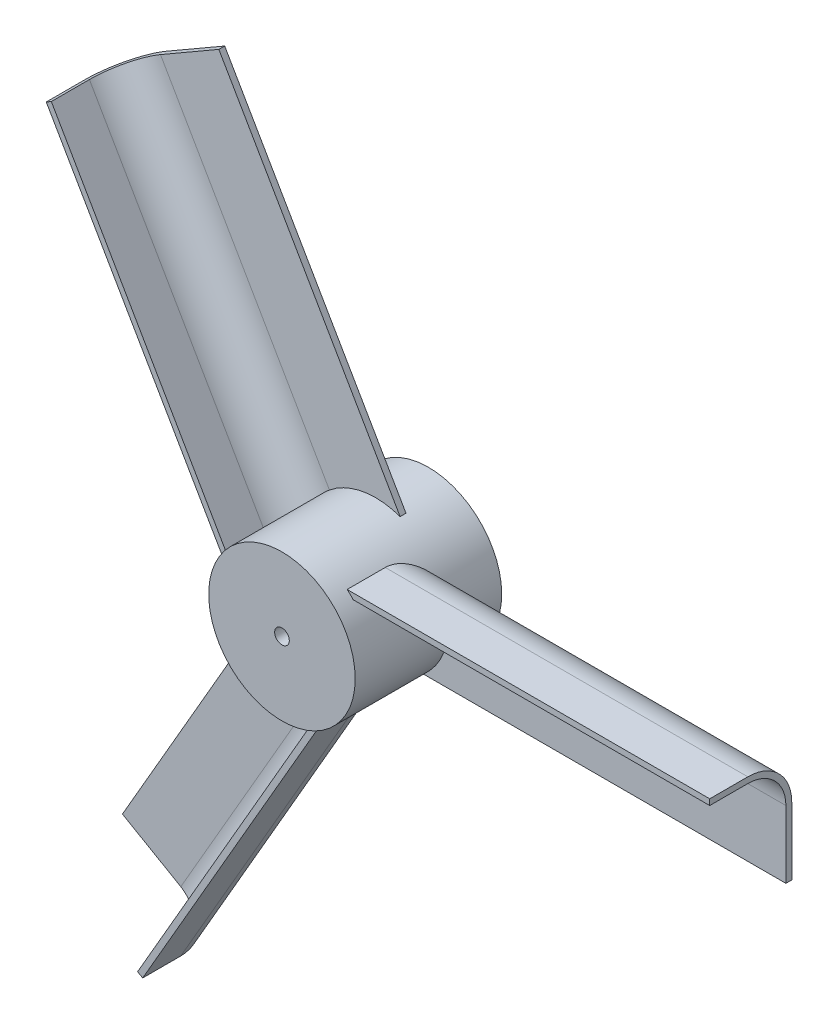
ISO-10303-21;
HEADER;
FILE_DESCRIPTION(('STEP AP214'),'2;1');
FILE_NAME('part.step','',(''),(''),'','','');
FILE_SCHEMA(('AUTOMOTIVE_DESIGN { 1 0 10303 214 1 1 1 1 }'));
ENDSEC;
DATA;
#1=APPLICATION_CONTEXT('core data for automotive mechanical design processes');
#2=APPLICATION_PROTOCOL_DEFINITION('international standard','automotive_design',2000,#1);
#3=PRODUCT_CONTEXT('',#1,'mechanical');
#4=PRODUCT('Part','Part','',(#3));
#5=PRODUCT_RELATED_PRODUCT_CATEGORY('part','',(#4));
#6=PRODUCT_DEFINITION_FORMATION('','',#4);
#7=PRODUCT_DEFINITION_CONTEXT('part definition',#1,'design');
#8=PRODUCT_DEFINITION('design','',#6,#7);
#9=PRODUCT_DEFINITION_SHAPE('','',#8);
#10=(LENGTH_UNIT() NAMED_UNIT(*) SI_UNIT(.MILLI.,.METRE.));
#11=(NAMED_UNIT(*) PLANE_ANGLE_UNIT() SI_UNIT($,.RADIAN.));
#12=(NAMED_UNIT(*) SI_UNIT($,.STERADIAN.) SOLID_ANGLE_UNIT());
#13=UNCERTAINTY_MEASURE_WITH_UNIT(LENGTH_MEASURE(1.E-05),#10,'distance_accuracy_value','');
#14=(GEOMETRIC_REPRESENTATION_CONTEXT(3) GLOBAL_UNCERTAINTY_ASSIGNED_CONTEXT((#13)) GLOBAL_UNIT_ASSIGNED_CONTEXT((#10,
#11,#12)) REPRESENTATION_CONTEXT('',''));
#15=CARTESIAN_POINT('',(0.,0.,0.));
#16=DIRECTION('',(0.,0.,1.));
#17=DIRECTION('',(1.,0.,0.));
#18=AXIS2_PLACEMENT_3D('',#15,#16,#17);
#19=CARTESIAN_POINT('',(0.,0.,25.));
#20=DIRECTION('',(0.,0.,1.));
#21=DIRECTION('',(1.,0.,0.));
#22=AXIS2_PLACEMENT_3D('',#19,#20,#21);
#23=PLANE('',#22);
#24=CARTESIAN_POINT('',(0.,0.,25.));
#25=DIRECTION('',(0.,0.,1.));
#26=DIRECTION('',(1.,0.,0.));
#27=AXIS2_PLACEMENT_3D('',#24,#25,#26);
#28=CIRCLE('',#27,12.5);
#29=CARTESIAN_POINT('',(12.5,0.,25.));
#30=VERTEX_POINT('',#29);
#31=EDGE_CURVE('E11',#30,#30,#28,.T.);
#32=ORIENTED_EDGE('',*,*,#31,.T.);
#33=EDGE_LOOP('',(#32));
#34=FACE_BOUND('',#33,.T.);
#35=CARTESIAN_POINT('',(0.,0.,25.));
#36=DIRECTION('',(0.,0.,1.));
#37=DIRECTION('',(1.,0.,0.));
#38=AXIS2_PLACEMENT_3D('',#35,#36,#37);
#39=CIRCLE('',#38,1.25);
#40=CARTESIAN_POINT('',(1.25,0.,25.));
#41=VERTEX_POINT('',#40);
#42=EDGE_CURVE('E505',#41,#41,#39,.T.);
#43=ORIENTED_EDGE('',*,*,#42,.F.);
#44=EDGE_LOOP('',(#43));
#45=FACE_BOUND('',#44,.T.);
#46=ADVANCED_FACE('F41',(#34,#45),#23,.T.);
#47=CARTESIAN_POINT('',(0.,0.,0.));
#48=DIRECTION('',(0.,0.,1.));
#49=DIRECTION('',(1.,0.,0.));
#50=AXIS2_PLACEMENT_3D('',#47,#48,#49);
#51=PLANE('',#50);
#52=CARTESIAN_POINT('',(0.,0.,0.));
#53=DIRECTION('',(0.,0.,1.));
#54=DIRECTION('',(1.,0.,0.));
#55=AXIS2_PLACEMENT_3D('',#52,#53,#54);
#56=CIRCLE('',#55,12.5);
#57=CARTESIAN_POINT('',(12.5,0.,0.));
#58=VERTEX_POINT('',#57);
#59=EDGE_CURVE('E45',#58,#58,#56,.T.);
#60=ORIENTED_EDGE('',*,*,#59,.F.);
#61=EDGE_LOOP('',(#60));
#62=FACE_BOUND('',#61,.T.);
#63=CARTESIAN_POINT('',(0.,0.,0.));
#64=DIRECTION('',(0.,0.,1.));
#65=DIRECTION('',(1.,0.,0.));
#66=AXIS2_PLACEMENT_3D('',#63,#64,#65);
#67=CIRCLE('',#66,1.25);
#68=CARTESIAN_POINT('',(1.25,0.,0.));
#69=VERTEX_POINT('',#68);
#70=EDGE_CURVE('E509',#69,#69,#67,.T.);
#71=ORIENTED_EDGE('',*,*,#70,.T.);
#72=EDGE_LOOP('',(#71));
#73=FACE_BOUND('',#72,.T.);
#74=ADVANCED_FACE('F454',(#62,#73),#51,.F.);
#75=CARTESIAN_POINT('',(0.,0.,25.));
#76=DIRECTION('',(0.,0.,-1.));
#77=DIRECTION('',(-1.,0.,0.));
#78=AXIS2_PLACEMENT_3D('',#75,#76,#77);
#79=CYLINDRICAL_SURFACE('',#78,12.5);
#80=CARTESIAN_POINT('',(0.,0.,22.));
#81=DIRECTION('',(0.,0.,1.));
#82=DIRECTION('',(1.,0.,0.));
#83=AXIS2_PLACEMENT_3D('',#80,#81,#82);
#84=CIRCLE('',#83,12.5);
#85=CARTESIAN_POINT('',(-12.2892605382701,2.28562363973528,22.));
#86=VERTEX_POINT('',#85);
#87=CARTESIAN_POINT('',(-11.9437916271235,3.68725393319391,22.));
#88=VERTEX_POINT('',#87);
#89=EDGE_CURVE('E579',#86,#88,#84,.F.);
#90=ORIENTED_EDGE('',*,*,#89,.F.);
#91=DIRECTION('',(0.,0.,-1.));
#92=VECTOR('',#91,1.);
#93=CARTESIAN_POINT('',(-12.2892605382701,2.28562363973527,25.));
#94=LINE('',#93,#92);
#95=CARTESIAN_POINT('',(-12.2892605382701,2.28562363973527,15.5));
#96=VERTEX_POINT('',#95);
#97=EDGE_CURVE('E297',#96,#86,#94,.F.);
#98=ORIENTED_EDGE('',*,*,#97,.F.);
#99=CARTESIAN_POINT('',(-7.90153214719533,9.68585513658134,8.));
#100=CARTESIAN_POINT('',(-8.06088930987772,9.55591319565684,7.99996358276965));
#101=CARTESIAN_POINT('',(-8.2169383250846,9.4220077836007,8.00823753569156));
#102=CARTESIAN_POINT('',(-8.52123663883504,9.14768525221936,8.04071329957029));
#103=CARTESIAN_POINT('',(-8.66949261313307,9.00727390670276,8.06490122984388));
#104=CARTESIAN_POINT('',(-8.95629751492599,8.72212323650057,8.12829220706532));
#105=CARTESIAN_POINT('',(-9.09490701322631,8.57742099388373,8.16738919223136));
#106=CARTESIAN_POINT('',(-9.36291256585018,8.28404087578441,8.25977329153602));
#107=CARTESIAN_POINT('',(-9.49230687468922,8.13536225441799,8.31306308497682));
#108=CARTESIAN_POINT('',(-9.74098616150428,7.83587562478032,8.43272068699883));
#109=CARTESIAN_POINT('',(-9.8603062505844,7.68507734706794,8.4990401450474));
#110=CARTESIAN_POINT('',(-10.0892294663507,7.38197361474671,8.64402139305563));
#111=CARTESIAN_POINT('',(-10.1988291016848,7.22966764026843,8.72268758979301));
#112=CARTESIAN_POINT('',(-10.4084387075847,6.92450183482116,8.89164339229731));
#113=CARTESIAN_POINT('',(-10.5084334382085,6.77164151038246,8.98195095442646));
#114=CARTESIAN_POINT('',(-10.6988049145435,6.46667565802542,9.17334830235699));
#115=CARTESIAN_POINT('',(-10.7891804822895,6.31457022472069,9.27443940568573));
#116=CARTESIAN_POINT('',(-10.9714545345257,5.99295793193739,9.50024276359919));
#117=CARTESIAN_POINT('',(-11.0620882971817,5.8236948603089,9.62632436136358));
#118=CARTESIAN_POINT('',(-11.2319238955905,5.48899802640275,9.89058397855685));
#119=CARTESIAN_POINT('',(-11.3111277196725,5.32356360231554,10.0287598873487));
#120=CARTESIAN_POINT('',(-11.4587469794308,4.99790946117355,10.3168067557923));
#121=CARTESIAN_POINT('',(-11.5271542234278,4.83769377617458,10.4666864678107));
#122=CARTESIAN_POINT('',(-11.6537156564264,4.52431838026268,10.7777080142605));
#123=CARTESIAN_POINT('',(-11.7118708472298,4.37115798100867,10.9388487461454));
#124=CARTESIAN_POINT('',(-11.8143953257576,4.08549339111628,11.2591915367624));
#125=CARTESIAN_POINT('',(-11.8594875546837,3.95231086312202,11.4175572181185));
#126=CARTESIAN_POINT('',(-11.9420305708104,3.69541657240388,11.7437457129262));
#127=CARTESIAN_POINT('',(-11.9794806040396,3.57170574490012,11.9115694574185));
#128=CARTESIAN_POINT('',(-12.0471975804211,3.33616914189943,12.2563986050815));
#129=CARTESIAN_POINT('',(-12.0774750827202,3.22432603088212,12.4333900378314));
#130=CARTESIAN_POINT('',(-12.1314306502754,3.01497546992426,12.7967138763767));
#131=CARTESIAN_POINT('',(-12.1551086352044,2.91746819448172,12.9830463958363));
#132=CARTESIAN_POINT('',(-12.190587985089,2.76475807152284,13.311260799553));
#133=CARTESIAN_POINT('',(-12.2038595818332,2.70534440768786,13.4510300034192));
#134=CARTESIAN_POINT('',(-12.22739374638,2.59690613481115,13.7347741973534));
#135=CARTESIAN_POINT('',(-12.2376572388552,2.54787833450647,13.8787478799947));
#136=CARTESIAN_POINT('',(-12.2553059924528,2.46158791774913,14.1699517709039));
#137=CARTESIAN_POINT('',(-12.2626988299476,2.42429438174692,14.3171723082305));
#138=CARTESIAN_POINT('',(-12.274763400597,2.3624526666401,14.6143259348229));
#139=CARTESIAN_POINT('',(-12.2794367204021,2.33789705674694,14.7642573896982));
#140=CARTESIAN_POINT('',(-12.2849548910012,2.30868313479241,15.0120214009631));
#141=CARTESIAN_POINT('',(-12.2865705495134,2.30005273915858,15.1093829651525));
#142=CARTESIAN_POINT('',(-12.2887227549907,2.28851555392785,15.3044908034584));
#143=CARTESIAN_POINT('',(-12.2892589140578,2.2856108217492,15.4022372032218));
#144=CARTESIAN_POINT('',(-12.2892605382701,2.28562363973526,15.5));
#145=B_SPLINE_CURVE_WITH_KNOTS('',3,(#99,#100,#101,#102,#103,#104,#105,#106,#107,#108,#109,#110,
#111,#112,#113,#114,#115,#116,#117,#118,#119,#120,#121,#122,#123,#124,#125,#126,#127,#128,#129,
#130,#131,#132,#133,#134,#135,#136,#137,#138,#139,#140,#141,#142,#143,#144),.UNSPECIFIED.,.F.,
.F.,(4,2,2,2,2,2,2,2,2,2,2,2,2,2,2,2,2,2,2,2,2,2,4),(0.,0.616542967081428,1.2325488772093,
1.84425194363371,2.45607056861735,3.06566033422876,3.67546817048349,4.28622812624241,
4.89706278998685,5.5854866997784,6.27379070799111,6.96261446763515,7.65137088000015,
8.28619058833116,8.9210728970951,9.55501466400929,10.1889641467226,10.645934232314,
11.1027637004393,11.558379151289,12.0137285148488,12.3068362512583,12.6000492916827),.UNSPECIFIED.);
#146=CARTESIAN_POINT('',(-7.90153214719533,9.68585513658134,8.));
#147=VERTEX_POINT('',#146);
#148=EDGE_CURVE('E210',#147,#96,#145,.T.);
#149=ORIENTED_EDGE('',*,*,#148,.F.);
#150=CARTESIAN_POINT('',(0.,0.,8.));
#151=DIRECTION('',(0.,0.,-1.));
#152=DIRECTION('',(-1.,0.,0.));
#153=AXIS2_PLACEMENT_3D('',#150,#151,#152);
#154=CIRCLE('',#153,12.5);
#155=CARTESIAN_POINT('',(4.16522213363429,11.7856236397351,8.));
#156=VERTEX_POINT('',#155);
#157=EDGE_CURVE('E214',#156,#147,#154,.F.);
#158=ORIENTED_EDGE('',*,*,#157,.F.);
#159=DIRECTION('',(0.,0.,-1.));
#160=VECTOR('',#159,1.);
#161=CARTESIAN_POINT('',(4.16522213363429,11.7856236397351,25.));
#162=LINE('',#161,#160);
#163=CARTESIAN_POINT('',(4.16522213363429,11.7856236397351,9.));
#164=VERTEX_POINT('',#163);
#165=EDGE_CURVE('E259',#164,#156,#162,.T.);
#166=ORIENTED_EDGE('',*,*,#165,.F.);
#167=CARTESIAN_POINT('',(0.,0.,9.));
#168=DIRECTION('',(0.,0.,1.));
#169=DIRECTION('',(1.,0.,0.));
#170=AXIS2_PLACEMENT_3D('',#167,#168,#169);
#171=CIRCLE('',#170,12.5);
#172=CARTESIAN_POINT('',(-7.90153214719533,9.68585513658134,9.));
#173=VERTEX_POINT('',#172);
#174=EDGE_CURVE('E262',#173,#164,#171,.F.);
#175=ORIENTED_EDGE('',*,*,#174,.F.);
#176=CARTESIAN_POINT('',(-11.9437916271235,3.6872539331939,15.5));
#177=CARTESIAN_POINT('',(-11.9437892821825,3.68716538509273,15.3433005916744));
#178=CARTESIAN_POINT('',(-11.9415125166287,3.69463510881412,15.1866477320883));
#179=CARTESIAN_POINT('',(-11.9324000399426,3.72401023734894,14.8750259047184));
#180=CARTESIAN_POINT('',(-11.9255700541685,3.74589751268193,14.720055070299));
#181=CARTESIAN_POINT('',(-11.9074310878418,3.80314599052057,14.4145036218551));
#182=CARTESIAN_POINT('',(-11.8961669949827,3.83837202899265,14.263894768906));
#183=CARTESIAN_POINT('',(-11.8691202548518,3.92121055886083,13.9665209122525));
#184=CARTESIAN_POINT('',(-11.8533364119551,3.96882632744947,13.8197569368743));
#185=CARTESIAN_POINT('',(-11.8172823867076,4.07491694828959,13.531633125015));
#186=CARTESIAN_POINT('',(-11.7970348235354,4.13333682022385,13.3902501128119));
#187=CARTESIAN_POINT('',(-11.7519357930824,4.25987370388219,13.1127068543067));
#188=CARTESIAN_POINT('',(-11.7270845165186,4.32799031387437,12.976546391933));
#189=CARTESIAN_POINT('',(-11.6453249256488,4.54536489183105,12.5757821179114));
#190=CARTESIAN_POINT('',(-11.5812816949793,4.70742657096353,12.3194720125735));
#191=CARTESIAN_POINT('',(-11.4222592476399,5.08225603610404,11.7949400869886));
#192=CARTESIAN_POINT('',(-11.3241078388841,5.29897770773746,11.5305507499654));
#193=CARTESIAN_POINT('',(-11.0993725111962,5.75486908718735,11.0349478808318));
#194=CARTESIAN_POINT('',(-10.9727701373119,5.994053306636,10.8037560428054));
#195=CARTESIAN_POINT('',(-10.7456718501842,6.38826566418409,10.4620630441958));
#196=CARTESIAN_POINT('',(-10.6547545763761,6.53902148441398,10.340076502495));
#197=CARTESIAN_POINT('',(-10.4615591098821,6.84385176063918,10.109880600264));
#198=CARTESIAN_POINT('',(-10.3592793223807,6.9979266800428,10.0016731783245));
#199=CARTESIAN_POINT('',(-10.1433592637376,7.30738041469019,9.80018502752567));
#200=CARTESIAN_POINT('',(-10.0297385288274,7.46275657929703,9.70687932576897));
#201=CARTESIAN_POINT('',(-9.79099280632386,7.77333902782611,9.5360601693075));
#202=CARTESIAN_POINT('',(-9.66587023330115,7.92854534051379,9.45854341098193));
#203=CARTESIAN_POINT('',(-9.4164300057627,8.22280642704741,9.32682893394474));
#204=CARTESIAN_POINT('',(-9.29310087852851,8.36203149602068,9.27114052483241));
#205=CARTESIAN_POINT('',(-9.03764944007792,8.63748593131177,9.17463898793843));
#206=CARTESIAN_POINT('',(-8.90552957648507,8.7737161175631,9.13382173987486));
#207=CARTESIAN_POINT('',(-8.63226560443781,9.04272969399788,9.06766997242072));
#208=CARTESIAN_POINT('',(-8.49106813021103,9.17548471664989,9.04243845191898));
#209=CARTESIAN_POINT('',(-8.27388189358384,9.37029203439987,9.01705938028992));
#210=CARTESIAN_POINT('',(-8.2005396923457,9.43454649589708,9.01067764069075));
#211=CARTESIAN_POINT('',(-8.05222262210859,9.56144563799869,9.00214736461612));
#212=CARTESIAN_POINT('',(-7.97724759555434,9.6240901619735,8.99999923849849));
#213=CARTESIAN_POINT('',(-7.90153214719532,9.68585513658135,9.));
#214=B_SPLINE_CURVE_WITH_KNOTS('',3,(#176,#177,#178,#179,#180,#181,#182,#183,#184,#185,#186,
#187,#188,#189,#190,#191,#192,#193,#194,#195,#196,#197,#198,#199,#200,#201,#202,#203,#204,#205,
#206,#207,#208,#209,#210,#211,#212,#213),.UNSPECIFIED.,.F.,.F.,(4,2,2,2,2,2,2,2,2,2,2,2,2,2,2,2,
2,2,4),(0.,0.469829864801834,0.939070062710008,1.40367736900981,1.86840769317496,
2.33083509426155,2.79324334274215,3.71990597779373,4.78344197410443,5.84766984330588,
6.48955329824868,7.13152696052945,7.77241322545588,8.41316525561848,8.99486603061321,
9.57640551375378,10.1617481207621,10.4547930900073,10.7478664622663),.UNSPECIFIED.);
#215=CARTESIAN_POINT('',(-11.9437916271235,3.68725393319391,15.5));
#216=VERTEX_POINT('',#215);
#217=EDGE_CURVE('E265',#216,#173,#214,.T.);
#218=ORIENTED_EDGE('',*,*,#217,.F.);
#219=DIRECTION('',(0.,0.,-1.));
#220=VECTOR('',#219,1.);
#221=CARTESIAN_POINT('',(-11.9437916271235,3.6872539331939,25.));
#222=LINE('',#221,#220);
#223=EDGE_CURVE('E274',#88,#216,#222,.T.);
#224=ORIENTED_EDGE('',*,*,#223,.F.);
#225=EDGE_LOOP('',(#90,#98,#149,#158,#166,#175,#218,#224));
#226=FACE_BOUND('',#225,.T.);
#227=CARTESIAN_POINT('',(0.,0.,22.));
#228=DIRECTION('',(0.,0.,1.));
#229=DIRECTION('',(1.,0.,0.));
#230=AXIS2_PLACEMENT_3D('',#227,#228,#229);
#231=CIRCLE('',#230,12.5);
#232=CARTESIAN_POINT('',(4.16522213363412,-11.7856236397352,22.));
#233=VERTEX_POINT('',#232);
#234=CARTESIAN_POINT('',(2.77864023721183,-12.1872539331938,22.));
#235=VERTEX_POINT('',#234);
#236=EDGE_CURVE('E575',#233,#235,#231,.F.);
#237=ORIENTED_EDGE('',*,*,#236,.F.);
#238=DIRECTION('',(0.,0.,-1.));
#239=VECTOR('',#238,1.);
#240=CARTESIAN_POINT('',(4.16522213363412,-11.7856236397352,25.));
#241=LINE('',#240,#239);
#242=CARTESIAN_POINT('',(4.16522213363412,-11.7856236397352,15.5));
#243=VERTEX_POINT('',#242);
#244=EDGE_CURVE('E395',#243,#233,#241,.F.);
#245=ORIENTED_EDGE('',*,*,#244,.F.);
#246=CARTESIAN_POINT('',(-4.43743053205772,-11.6858551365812,8.));
#247=CARTESIAN_POINT('',(-4.24521892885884,-11.758891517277,7.99996358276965));
#248=CARTESIAN_POINT('',(-4.05122893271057,-11.8270812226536,8.00823753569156));
#249=CARTESIAN_POINT('',(-3.66150949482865,-11.9534500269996,8.0407132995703));
#250=CARTESIAN_POINT('',(-3.46578171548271,-12.0116377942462,8.06490122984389));
#251=CARTESIAN_POINT('',(-3.07543154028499,-12.1174427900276,8.12829220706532));
#252=CARTESIAN_POINT('',(-2.88081097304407,-12.1651310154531,8.16738919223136));
#253=CARTESIAN_POINT('',(-2.49273356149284,-12.250540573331,8.25977329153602));
#254=CARTESIAN_POINT('',(-2.29927694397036,-12.2882600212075,8.31306308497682));
#255=CARTESIAN_POINT('',(-1.91557427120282,-12.3538792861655,8.43272068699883));
#256=CARTESIAN_POINT('',(-1.7253190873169,-12.3818143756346,8.4990401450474));
#257=CARTESIAN_POINT('',(-1.34836194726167,-12.4285158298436,8.64402139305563));
#258=CARTESIAN_POINT('',(-1.1616612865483,-12.4472789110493,8.72268758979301));
#259=CARTESIAN_POINT('',(-0.792575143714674,-12.4762232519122,8.8916433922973));
#260=CARTESIAN_POINT('',(-0.610196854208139,-12.4863910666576,8.98195095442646));
#261=CARTESIAN_POINT('',(-0.250902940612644,-12.4987746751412,9.17334830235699));
#262=CARTESIAN_POINT('',(-0.0739879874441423,-12.5009894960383,9.27443940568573));
#263=CARTESIAN_POINT('',(0.29567345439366,-12.4980373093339,9.50024276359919));
#264=CARTESIAN_POINT('',(0.487576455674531,-12.4918969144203,9.62632436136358));
#265=CARTESIAN_POINT('',(0.862350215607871,-12.4716304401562,9.89058397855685));
#266=CARTESIAN_POINT('',(1.04522254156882,-12.4575057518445,10.0287598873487));
#267=CARTESIAN_POINT('',(1.40105693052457,-12.4225207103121,10.3168067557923));
#268=CARTESIAN_POINT('',(1.57401140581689,-12.4016552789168,10.4666864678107));
#269=CARTESIAN_POINT('',(1.90868317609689,-12.354572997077,10.7777080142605));
#270=CARTESIAN_POINT('',(2.07040156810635,-12.3283566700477,10.9388487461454));
#271=CARTESIAN_POINT('',(2.36905659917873,-12.2743131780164,11.2591915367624));
#272=CARTESIAN_POINT('',(2.50694216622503,-12.2467729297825,11.4175572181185));
#273=CARTESIAN_POINT('',(2.77069065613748,-12.1898101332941,11.7437457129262));
#274=CARTESIAN_POINT('',(2.89655239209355,-12.1603873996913,11.9115694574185));
#275=CARTESIAN_POINT('',(3.13439156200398,-12.1012637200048,12.2563986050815));
#276=CARTESIAN_POINT('',(3.24638928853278,-12.0715632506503,12.4333900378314));
#277=CARTESIAN_POINT('',(3.45466997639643,-12.0136148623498,12.7967138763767));
#278=CARTESIAN_POINT('',(3.55095274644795,-11.9853669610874,12.9830463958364));
#279=CARTESIAN_POINT('',(3.7009432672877,-11.9397379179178,13.311260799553));
#280=CARTESIAN_POINT('',(3.75903280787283,-11.9215246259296,13.4510300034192));
#281=CARTESIAN_POINT('',(3.86471018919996,-11.8876866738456,13.7347741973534));
#282=CARTESIAN_POINT('',(3.9123012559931,-11.8720612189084,13.8787478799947));
#283=CARTESIAN_POINT('',(3.99585532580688,-11.8442002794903,14.1699517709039));
#284=CARTESIAN_POINT('',(4.03184889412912,-11.8319558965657,14.3171723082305));
#285=CARTESIAN_POINT('',(4.09143767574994,-11.8114832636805,14.6143259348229));
#286=CARTESIAN_POINT('',(4.11504011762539,-11.8032526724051,14.7642573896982));
#287=CARTESIAN_POINT('',(4.14309920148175,-11.7934245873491,15.0120214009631));
#288=CARTESIAN_POINT('',(4.15138117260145,-11.7905085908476,15.1093829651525));
#289=CARTESIAN_POINT('',(4.16244877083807,-11.7866038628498,15.3044908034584));
#290=CARTESIAN_POINT('',(4.16523242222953,-11.785615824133,15.4022372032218));
#291=CARTESIAN_POINT('',(4.16522213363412,-11.7856236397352,15.5));
#292=B_SPLINE_CURVE_WITH_KNOTS('',3,(#246,#247,#248,#249,#250,#251,#252,#253,#254,#255,#256,
#257,#258,#259,#260,#261,#262,#263,#264,#265,#266,#267,#268,#269,#270,#271,#272,#273,#274,#275,
#276,#277,#278,#279,#280,#281,#282,#283,#284,#285,#286,#287,#288,#289,#290,#291),.UNSPECIFIED.,
.F.,.F.,(4,2,2,2,2,2,2,2,2,2,2,2,2,2,2,2,2,2,2,2,2,2,4),(0.,0.616542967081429,1.2325488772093,
1.84425194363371,2.45607056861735,3.06566033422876,3.67546817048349,4.2862281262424,
4.89706278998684,5.5854866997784,6.27379070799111,6.96261446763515,7.65137088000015,
8.28619058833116,8.92107289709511,9.5550146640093,10.1889641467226,10.645934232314,
11.1027637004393,11.558379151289,12.0137285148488,12.3068362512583,12.6000492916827),.UNSPECIFIED.);
#293=CARTESIAN_POINT('',(-4.43743053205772,-11.6858551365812,8.));
#294=VERTEX_POINT('',#293);
#295=EDGE_CURVE('E386',#294,#243,#292,.T.);
#296=ORIENTED_EDGE('',*,*,#295,.F.);
#297=CARTESIAN_POINT('',(0.,0.,8.));
#298=DIRECTION('',(0.,0.,-1.));
#299=DIRECTION('',(-1.,0.,0.));
#300=AXIS2_PLACEMENT_3D('',#297,#298,#299);
#301=CIRCLE('',#300,12.5);
#302=CARTESIAN_POINT('',(-12.2892605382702,-2.28562363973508,8.));
#303=VERTEX_POINT('',#302);
#304=EDGE_CURVE('E352',#303,#294,#301,.F.);
#305=ORIENTED_EDGE('',*,*,#304,.F.);
#306=DIRECTION('',(0.,0.,-1.));
#307=VECTOR('',#306,1.);
#308=CARTESIAN_POINT('',(-12.2892605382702,-2.28562363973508,25.));
#309=LINE('',#308,#307);
#310=CARTESIAN_POINT('',(-12.2892605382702,-2.28562363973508,9.));
#311=VERTEX_POINT('',#310);
#312=EDGE_CURVE('E355',#311,#303,#309,.T.);
#313=ORIENTED_EDGE('',*,*,#312,.F.);
#314=CARTESIAN_POINT('',(0.,0.,9.));
#315=DIRECTION('',(0.,0.,1.));
#316=DIRECTION('',(1.,0.,0.));
#317=AXIS2_PLACEMENT_3D('',#314,#315,#316);
#318=CIRCLE('',#317,12.5);
#319=CARTESIAN_POINT('',(-4.43743053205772,-11.6858551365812,9.));
#320=VERTEX_POINT('',#319);
#321=EDGE_CURVE('E356',#320,#311,#318,.F.);
#322=ORIENTED_EDGE('',*,*,#321,.F.);
#323=CARTESIAN_POINT('',(2.77864023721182,-12.1872539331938,15.5));
#324=CARTESIAN_POINT('',(2.77871574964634,-12.1872076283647,15.3433005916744));
#325=CARTESIAN_POINT('',(2.77110839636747,-12.1889707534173,15.1866477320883));
#326=CARTESIAN_POINT('',(2.74111255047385,-12.1957666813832,14.8750259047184));
#327=CARTESIAN_POINT('',(2.71874262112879,-12.2007953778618,14.720055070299));
#328=CARTESIAN_POINT('',(2.6600945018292,-12.2137108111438,14.4145036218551));
#329=CARTESIAN_POINT('',(2.62395581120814,-12.2215688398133,14.263894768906));
#330=CARTESIAN_POINT('',(2.53869216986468,-12.2395649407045,13.9665209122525));
#331=CARTESIAN_POINT('',(2.48956378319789,-12.249703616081,13.8197569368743));
#332=CARTESIAN_POINT('',(2.37965959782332,-12.271525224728,13.531633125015));
#333=CARTESIAN_POINT('',(2.31894272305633,-12.2832002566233,13.3902501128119));
#334=CARTESIAN_POINT('',(2.18680905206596,-12.307411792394,13.1127068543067));
#335=CARTESIAN_POINT('',(2.11539269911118,-12.3199482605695,12.976546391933));
#336=CARTESIAN_POINT('',(1.88626099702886,-12.3578296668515,12.5757821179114));
#337=CARTESIAN_POINT('',(1.71388985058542,-12.3833974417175,12.3194720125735));
#338=CARTESIAN_POINT('',(1.30976678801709,-12.4330946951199,11.7949400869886));
#339=CARTESIAN_POINT('',(1.07300461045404,-12.4564539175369,11.5305507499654));
#340=CARTESIAN_POINT('',(0.565823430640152,-12.4897731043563,11.0349478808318));
#341=CARTESIAN_POINT('',(0.295382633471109,-12.4997243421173,10.8037560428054));
#342=CARTESIAN_POINT('',(-0.159564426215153,-12.5001576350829,10.4620630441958));
#343=CARTESIAN_POINT('',(-0.335581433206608,-12.4967988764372,10.340076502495));
#344=CARTESIAN_POINT('',(-0.696169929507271,-12.48190183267,10.109880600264));
#345=CARTESIAN_POINT('',(-0.880742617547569,-12.4703623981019,10.0016731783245));
#346=CARTESIAN_POINT('',(-1.25669744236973,-12.438097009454,9.80018502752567));
#347=CARTESIAN_POINT('',(-1.44806751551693,-12.4173866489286,9.70687932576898));
#348=CARTESIAN_POINT('',(-1.83641266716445,-12.3659180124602,9.53606016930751));
#349=CARTESIAN_POINT('',(-2.03338656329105,-12.3351618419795,9.45854341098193));
#350=CARTESIAN_POINT('',(-2.4129442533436,-12.2662708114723,9.32682893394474));
#351=CARTESIAN_POINT('',(-2.59518126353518,-12.2290771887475,9.27114052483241));
#352=CARTESIAN_POINT('',(-2.96145752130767,-12.1455769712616,9.17463898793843));
#353=CARTESIAN_POINT('',(-3.14549625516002,-12.0992729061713,9.13382173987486));
#354=CARTESIAN_POINT('',(-3.51510083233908,-11.9971261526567,9.06766997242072));
#355=CARTESIAN_POINT('',(-3.70066879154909,-11.9412230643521,9.04243845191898));
#356=CARTESIAN_POINT('',(-3.97796999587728,-11.8505379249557,9.01705938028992));
#357=CARTESIAN_POINT('',(-4.07028709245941,-11.8191489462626,9.01067764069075));
#358=CARTESIAN_POINT('',(-4.25434350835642,-11.7541521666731,9.00214736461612));
#359=CARTESIAN_POINT('',(-4.34608277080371,-11.7205441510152,8.99999923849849));
#360=CARTESIAN_POINT('',(-4.43743053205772,-11.6858551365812,9.));
#361=B_SPLINE_CURVE_WITH_KNOTS('',3,(#323,#324,#325,#326,#327,#328,#329,#330,#331,#332,#333,
#334,#335,#336,#337,#338,#339,#340,#341,#342,#343,#344,#345,#346,#347,#348,#349,#350,#351,#352,
#353,#354,#355,#356,#357,#358,#359,#360),.UNSPECIFIED.,.F.,.F.,(4,2,2,2,2,2,2,2,2,2,2,2,2,2,2,2,
2,2,4),(0.,0.469829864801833,0.939070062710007,1.40367736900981,1.86840769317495,
2.33083509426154,2.79324334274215,3.71990597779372,4.78344197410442,5.84766984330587,
6.48955329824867,7.13152696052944,7.77241322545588,8.41316525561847,8.9948660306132,
9.57640551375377,10.1617481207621,10.4547930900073,10.7478664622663),.UNSPECIFIED.);
#362=CARTESIAN_POINT('',(2.77864023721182,-12.1872539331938,15.5));
#363=VERTEX_POINT('',#362);
#364=EDGE_CURVE('E359',#363,#320,#361,.T.);
#365=ORIENTED_EDGE('',*,*,#364,.F.);
#366=DIRECTION('',(0.,0.,-1.));
#367=VECTOR('',#366,1.);
#368=CARTESIAN_POINT('',(2.77864023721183,-12.1872539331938,25.));
#369=LINE('',#368,#367);
#370=EDGE_CURVE('E370',#235,#363,#369,.T.);
#371=ORIENTED_EDGE('',*,*,#370,.F.);
#372=EDGE_LOOP('',(#237,#245,#296,#305,#313,#322,#365,#371));
#373=FACE_BOUND('',#372,.T.);
#374=CARTESIAN_POINT('',(0.,0.,22.));
#375=DIRECTION('',(0.,0.,1.));
#376=DIRECTION('',(1.,0.,0.));
#377=AXIS2_PLACEMENT_3D('',#374,#375,#376);
#378=CIRCLE('',#377,12.5);
#379=CARTESIAN_POINT('',(8.12403840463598,9.49999999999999,22.));
#380=VERTEX_POINT('',#379);
#381=CARTESIAN_POINT('',(9.1651513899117,8.5,22.));
#382=VERTEX_POINT('',#381);
#383=EDGE_CURVE('E502',#380,#382,#378,.F.);
#384=ORIENTED_EDGE('',*,*,#383,.F.);
#385=DIRECTION('',(0.,0.,-1.));
#386=VECTOR('',#385,1.);
#387=CARTESIAN_POINT('',(8.12403840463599,9.49999999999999,25.));
#388=LINE('',#387,#386);
#389=CARTESIAN_POINT('',(8.12403840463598,9.5,15.5));
#390=VERTEX_POINT('',#389);
#391=EDGE_CURVE('E403',#390,#380,#388,.F.);
#392=ORIENTED_EDGE('',*,*,#391,.F.);
#393=CARTESIAN_POINT('',(12.3389626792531,2.,8.));
#394=CARTESIAN_POINT('',(12.3061082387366,2.20297832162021,7.99996358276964));
#395=CARTESIAN_POINT('',(12.2681672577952,2.40507343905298,8.00823753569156));
#396=CARTESIAN_POINT('',(12.1827461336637,2.8057647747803,8.04071329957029));
#397=CARTESIAN_POINT('',(12.1352743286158,3.0043638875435,8.06490122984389));
#398=CARTESIAN_POINT('',(12.031729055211,3.39531955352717,8.12829220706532));
#399=CARTESIAN_POINT('',(11.9757179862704,3.58771002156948,8.16738919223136));
#400=CARTESIAN_POINT('',(11.855646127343,3.9664996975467,8.25977329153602));
#401=CARTESIAN_POINT('',(11.7915838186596,4.15289776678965,8.31306308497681));
#402=CARTESIAN_POINT('',(11.6565604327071,4.51800366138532,8.43272068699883));
#403=CARTESIAN_POINT('',(11.5856253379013,4.69673702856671,8.4990401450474));
#404=CARTESIAN_POINT('',(11.4375914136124,5.04654221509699,8.64402139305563));
#405=CARTESIAN_POINT('',(11.3604903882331,5.21761127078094,8.72268758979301));
#406=CARTESIAN_POINT('',(11.2010138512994,5.55172141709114,8.8916433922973));
#407=CARTESIAN_POINT('',(11.1186302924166,5.71474955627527,8.98195095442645));
#408=CARTESIAN_POINT('',(10.9497078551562,6.03209901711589,9.17334830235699));
#409=CARTESIAN_POINT('',(10.8631684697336,6.18641927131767,9.27443940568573));
#410=CARTESIAN_POINT('',(10.675781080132,6.50507937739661,9.50024276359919));
#411=CARTESIAN_POINT('',(10.5745118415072,6.66820205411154,9.62632436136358));
#412=CARTESIAN_POINT('',(10.3695736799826,6.98263241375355,9.89058397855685));
#413=CARTESIAN_POINT('',(10.2659051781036,7.13394214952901,10.0287598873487));
#414=CARTESIAN_POINT('',(10.0576900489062,7.4246112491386,10.3168067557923));
#415=CARTESIAN_POINT('',(9.95314281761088,7.56396150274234,10.4666864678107));
#416=CARTESIAN_POINT('',(9.74503248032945,7.83025461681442,10.7777080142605));
#417=CARTESIAN_POINT('',(9.64146927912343,7.95719868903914,10.9388487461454));
#418=CARTESIAN_POINT('',(9.44533872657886,8.18881978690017,11.2591915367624));
#419=CARTESIAN_POINT('',(9.35254538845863,8.29446206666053,11.4175572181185));
#420=CARTESIAN_POINT('',(9.1713399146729,8.49439356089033,11.7437457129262));
#421=CARTESIAN_POINT('',(9.08292821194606,8.5886816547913,11.9115694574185));
#422=CARTESIAN_POINT('',(8.91280601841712,8.76509457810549,12.2563986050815));
#423=CARTESIAN_POINT('',(8.83108579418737,8.84723721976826,12.4333900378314));
#424=CARTESIAN_POINT('',(8.67676067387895,8.99863939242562,12.7967138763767));
#425=CARTESIAN_POINT('',(8.6041558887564,9.0678987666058,12.9830463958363));
#426=CARTESIAN_POINT('',(8.48964471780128,9.17497984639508,13.311260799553));
#427=CARTESIAN_POINT('',(8.44482677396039,9.21618021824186,13.4510300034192));
#428=CARTESIAN_POINT('',(8.36268355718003,9.29078053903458,13.7347741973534));
#429=CARTESIAN_POINT('',(8.32535598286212,9.32418288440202,13.8787478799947));
#430=CARTESIAN_POINT('',(8.25945066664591,9.38261236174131,14.1699517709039));
#431=CARTESIAN_POINT('',(8.23084993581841,9.40766151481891,14.3171723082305));
#432=CARTESIAN_POINT('',(8.18332572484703,9.44903059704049,14.6143259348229));
#433=CARTESIAN_POINT('',(8.16439660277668,9.4653556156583,14.7642573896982));
#434=CARTESIAN_POINT('',(8.14185568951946,9.48474145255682,15.0120214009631));
#435=CARTESIAN_POINT('',(8.13518937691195,9.49045585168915,15.1093829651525));
#436=CARTESIAN_POINT('',(8.12627398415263,9.49808830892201,15.3044908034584));
#437=CARTESIAN_POINT('',(8.12402649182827,9.50000500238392,15.4022372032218));
#438=CARTESIAN_POINT('',(8.12403840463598,9.5,15.5));
#439=B_SPLINE_CURVE_WITH_KNOTS('',3,(#393,#394,#395,#396,#397,#398,#399,#400,#401,#402,#403,
#404,#405,#406,#407,#408,#409,#410,#411,#412,#413,#414,#415,#416,#417,#418,#419,#420,#421,#422,
#423,#424,#425,#426,#427,#428,#429,#430,#431,#432,#433,#434,#435,#436,#437,#438),.UNSPECIFIED.,
.F.,.F.,(4,2,2,2,2,2,2,2,2,2,2,2,2,2,2,2,2,2,2,2,2,2,4),(0.,0.616542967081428,1.2325488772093,
1.84425194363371,2.45607056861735,3.06566033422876,3.67546817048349,4.2862281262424,
4.89706278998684,5.5854866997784,6.27379070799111,6.96261446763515,7.65137088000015,
8.28619058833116,8.9210728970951,9.55501466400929,10.1889641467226,10.645934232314,
11.1027637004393,11.558379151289,12.0137285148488,12.3068362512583,12.6000492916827),.UNSPECIFIED.);
#440=CARTESIAN_POINT('',(12.3389626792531,2.,8.));
#441=VERTEX_POINT('',#440);
#442=EDGE_CURVE('E394',#441,#390,#439,.T.);
#443=ORIENTED_EDGE('',*,*,#442,.F.);
#444=CARTESIAN_POINT('',(0.,0.,8.));
#445=DIRECTION('',(0.,0.,-1.));
#446=DIRECTION('',(0.,1.,0.));
#447=AXIS2_PLACEMENT_3D('',#444,#445,#446);
#448=CIRCLE('',#447,12.5);
#449=CARTESIAN_POINT('',(8.12403840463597,-9.50000000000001,8.));
#450=VERTEX_POINT('',#449);
#451=EDGE_CURVE('E491',#450,#441,#448,.F.);
#452=ORIENTED_EDGE('',*,*,#451,.F.);
#453=DIRECTION('',(0.,0.,-1.));
#454=VECTOR('',#453,1.);
#455=CARTESIAN_POINT('',(8.12403840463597,-9.50000000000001,25.));
#456=LINE('',#455,#454);
#457=CARTESIAN_POINT('',(8.12403840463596,-9.50000000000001,9.));
#458=VERTEX_POINT('',#457);
#459=EDGE_CURVE('E424',#458,#450,#456,.T.);
#460=ORIENTED_EDGE('',*,*,#459,.F.);
#461=CARTESIAN_POINT('',(0.,0.,9.));
#462=DIRECTION('',(0.,0.,1.));
#463=DIRECTION('',(1.,0.,0.));
#464=AXIS2_PLACEMENT_3D('',#461,#462,#463);
#465=CIRCLE('',#464,12.5);
#466=CARTESIAN_POINT('',(12.3389626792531,2.,9.));
#467=VERTEX_POINT('',#466);
#468=EDGE_CURVE('E422',#467,#458,#465,.F.);
#469=ORIENTED_EDGE('',*,*,#468,.F.);
#470=CARTESIAN_POINT('',(9.1651513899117,8.5,15.5));
#471=CARTESIAN_POINT('',(9.16507353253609,8.50004224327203,15.3433005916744));
#472=CARTESIAN_POINT('',(9.17040412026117,8.49433564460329,15.1866477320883));
#473=CARTESIAN_POINT('',(9.19128748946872,8.47175644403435,14.8750259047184));
#474=CARTESIAN_POINT('',(9.20682743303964,8.45489786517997,14.720055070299));
#475=CARTESIAN_POINT('',(9.24733658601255,8.41056482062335,14.4145036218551));
#476=CARTESIAN_POINT('',(9.27221118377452,8.38319681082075,14.263894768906));
#477=CARTESIAN_POINT('',(9.33042808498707,8.31835438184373,13.9665209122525));
#478=CARTESIAN_POINT('',(9.36377262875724,8.28087728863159,13.8197569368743));
#479=CARTESIAN_POINT('',(9.43762278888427,8.19660827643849,13.531633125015));
#480=CARTESIAN_POINT('',(9.47809210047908,8.14986343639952,13.3902501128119));
#481=CARTESIAN_POINT('',(9.5651267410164,8.04753808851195,13.1127068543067));
#482=CARTESIAN_POINT('',(9.61169181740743,7.99195794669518,12.976546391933));
#483=CARTESIAN_POINT('',(9.75906392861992,7.81246477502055,12.5757821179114));
#484=CARTESIAN_POINT('',(9.86739184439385,7.67597087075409,12.3194720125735));
#485=CARTESIAN_POINT('',(10.1124924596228,7.35083865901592,11.7949400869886));
#486=CARTESIAN_POINT('',(10.2511032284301,7.1574762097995,11.5305507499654));
#487=CARTESIAN_POINT('',(10.533549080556,6.73490401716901,11.0349478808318));
#488=CARTESIAN_POINT('',(10.6773875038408,6.50567103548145,10.8037560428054));
#489=CARTESIAN_POINT('',(10.9052362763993,6.11189197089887,10.4620630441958));
#490=CARTESIAN_POINT('',(10.9903360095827,5.95777739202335,10.340076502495));
#491=CARTESIAN_POINT('',(11.1577290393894,5.63805007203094,10.109880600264));
#492=CARTESIAN_POINT('',(11.2400219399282,5.4724357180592,10.0016731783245));
#493=CARTESIAN_POINT('',(11.4000567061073,5.13071659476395,9.80018502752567));
#494=CARTESIAN_POINT('',(11.4778060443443,4.95463006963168,9.70687932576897));
#495=CARTESIAN_POINT('',(11.6274054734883,4.59257898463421,9.53606016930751));
#496=CARTESIAN_POINT('',(11.6992567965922,4.40661650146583,9.45854341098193));
#497=CARTESIAN_POINT('',(11.8293742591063,4.04346438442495,9.32682893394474));
#498=CARTESIAN_POINT('',(11.8882821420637,3.86704569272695,9.27114052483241));
#499=CARTESIAN_POINT('',(11.9991069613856,3.50809103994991,9.17463898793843));
#500=CARTESIAN_POINT('',(12.0510258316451,3.32555678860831,9.13382173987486));
#501=CARTESIAN_POINT('',(12.1473664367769,2.95439645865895,9.06766997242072));
#502=CARTESIAN_POINT('',(12.1917369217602,2.76573834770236,9.04243845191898));
#503=CARTESIAN_POINT('',(12.2518518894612,2.48024589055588,9.01705938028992));
#504=CARTESIAN_POINT('',(12.2708267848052,2.38460245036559,9.01067764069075));
#505=CARTESIAN_POINT('',(12.306566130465,2.19270652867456,9.00214736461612));
#506=CARTESIAN_POINT('',(12.3233303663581,2.09645398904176,8.99999923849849));
#507=CARTESIAN_POINT('',(12.3389626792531,2.,9.));
#508=B_SPLINE_CURVE_WITH_KNOTS('',3,(#470,#471,#472,#473,#474,#475,#476,#477,#478,#479,#480,
#481,#482,#483,#484,#485,#486,#487,#488,#489,#490,#491,#492,#493,#494,#495,#496,#497,#498,#499,
#500,#501,#502,#503,#504,#505,#506,#507),.UNSPECIFIED.,.F.,.F.,(4,2,2,2,2,2,2,2,2,2,2,2,2,2,2,2,
2,2,4),(0.,0.469829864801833,0.939070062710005,1.40367736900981,1.86840769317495,
2.33083509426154,2.79324334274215,3.71990597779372,4.78344197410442,5.84766984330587,
6.48955329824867,7.13152696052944,7.77241322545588,8.41316525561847,8.9948660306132,
9.57640551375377,10.1617481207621,10.4547930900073,10.7478664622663),.UNSPECIFIED.);
#509=CARTESIAN_POINT('',(9.1651513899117,8.5,15.5));
#510=VERTEX_POINT('',#509);
#511=EDGE_CURVE('E415',#510,#467,#508,.T.);
#512=ORIENTED_EDGE('',*,*,#511,.F.);
#513=DIRECTION('',(0.,0.,-1.));
#514=VECTOR('',#513,1.);
#515=CARTESIAN_POINT('',(9.1651513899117,8.49999999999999,25.));
#516=LINE('',#515,#514);
#517=EDGE_CURVE('E423',#382,#510,#516,.T.);
#518=ORIENTED_EDGE('',*,*,#517,.F.);
#519=EDGE_LOOP('',(#384,#392,#443,#452,#460,#469,#512,#518));
#520=FACE_BOUND('',#519,.T.);
#521=ORIENTED_EDGE('',*,*,#31,.F.);
#522=EDGE_LOOP('',(#521));
#523=FACE_BOUND('',#522,.T.);
#524=ORIENTED_EDGE('',*,*,#59,.T.);
#525=EDGE_LOOP('',(#524));
#526=FACE_BOUND('',#525,.T.);
#527=ADVANCED_FACE('F43',(#226,#373,#520,#523,#526),#79,.T.);
#528=CARTESIAN_POINT('',(0.,0.,25.));
#529=DIRECTION('',(0.,0.,-1.));
#530=DIRECTION('',(-1.,0.,0.));
#531=AXIS2_PLACEMENT_3D('',#528,#529,#530);
#532=CYLINDRICAL_SURFACE('',#531,1.25);
#533=ORIENTED_EDGE('',*,*,#42,.T.);
#534=EDGE_LOOP('',(#533));
#535=FACE_BOUND('',#534,.T.);
#536=ORIENTED_EDGE('',*,*,#70,.F.);
#537=EDGE_LOOP('',(#536));
#538=FACE_BOUND('',#537,.T.);
#539=ADVANCED_FACE('F439',(#535,#538),#532,.F.);
#540=CARTESIAN_POINT('',(-12.502,9.5,15.5));
#541=DIRECTION('',(0.,1.,0.));
#542=DIRECTION('',(0.,0.,1.));
#543=AXIS2_PLACEMENT_3D('',#540,#541,#542);
#544=PLANE('',#543);
#545=DIRECTION('',(1.,0.,0.));
#546=VECTOR('',#545,1.);
#547=CARTESIAN_POINT('',(-12.502,9.5,15.5));
#548=LINE('',#547,#546);
#549=CARTESIAN_POINT('',(70.,9.5,15.5));
#550=VERTEX_POINT('',#549);
#551=EDGE_CURVE('E495',#390,#550,#548,.T.);
#552=ORIENTED_EDGE('',*,*,#551,.F.);
#553=ORIENTED_EDGE('',*,*,#391,.T.);
#554=DIRECTION('',(1.,0.,0.));
#555=VECTOR('',#554,1.);
#556=CARTESIAN_POINT('',(-12.502,9.5,22.));
#557=LINE('',#556,#555);
#558=CARTESIAN_POINT('',(70.,9.5,22.));
#559=VERTEX_POINT('',#558);
#560=EDGE_CURVE('E546',#380,#559,#557,.T.);
#561=ORIENTED_EDGE('',*,*,#560,.T.);
#562=DIRECTION('',(0.,0.,1.));
#563=VECTOR('',#562,1.);
#564=CARTESIAN_POINT('',(70.,9.5,15.5));
#565=LINE('',#564,#563);
#566=EDGE_CURVE('E541',#550,#559,#565,.T.);
#567=ORIENTED_EDGE('',*,*,#566,.F.);
#568=EDGE_LOOP('',(#552,#553,#561,#567));
#569=FACE_BOUND('',#568,.T.);
#570=ADVANCED_FACE('F436',(#569),#544,.T.);
#571=CARTESIAN_POINT('',(-12.502,9.5,22.));
#572=DIRECTION('',(0.,0.,1.));
#573=DIRECTION('',(1.,0.,0.));
#574=AXIS2_PLACEMENT_3D('',#571,#572,#573);
#575=PLANE('',#574);
#576=ORIENTED_EDGE('',*,*,#560,.F.);
#577=ORIENTED_EDGE('',*,*,#383,.T.);
#578=DIRECTION('',(1.,0.,0.));
#579=VECTOR('',#578,1.);
#580=CARTESIAN_POINT('',(-12.502,8.5,22.));
#581=LINE('',#580,#579);
#582=CARTESIAN_POINT('',(70.,8.5,22.));
#583=VERTEX_POINT('',#582);
#584=EDGE_CURVE('E549',#382,#583,#581,.T.);
#585=ORIENTED_EDGE('',*,*,#584,.T.);
#586=DIRECTION('',(0.,-1.,0.));
#587=VECTOR('',#586,1.);
#588=CARTESIAN_POINT('',(70.,9.5,22.));
#589=LINE('',#588,#587);
#590=EDGE_CURVE('E532',#559,#583,#589,.T.);
#591=ORIENTED_EDGE('',*,*,#590,.F.);
#592=EDGE_LOOP('',(#576,#577,#585,#591));
#593=FACE_BOUND('',#592,.T.);
#594=ADVANCED_FACE('F411',(#593),#575,.T.);
#595=CARTESIAN_POINT('',(-12.502,8.5,15.5));
#596=DIRECTION('',(0.,-1.,0.));
#597=DIRECTION('',(0.,0.,-1.));
#598=AXIS2_PLACEMENT_3D('',#595,#596,#597);
#599=PLANE('',#598);
#600=ORIENTED_EDGE('',*,*,#584,.F.);
#601=ORIENTED_EDGE('',*,*,#517,.T.);
#602=DIRECTION('',(1.,0.,0.));
#603=VECTOR('',#602,1.);
#604=CARTESIAN_POINT('',(-12.502,8.5,15.5));
#605=LINE('',#604,#603);
#606=CARTESIAN_POINT('',(70.,8.5,15.5));
#607=VERTEX_POINT('',#606);
#608=EDGE_CURVE('E552',#510,#607,#605,.T.);
#609=ORIENTED_EDGE('',*,*,#608,.T.);
#610=DIRECTION('',(0.,0.,-1.));
#611=VECTOR('',#610,1.);
#612=CARTESIAN_POINT('',(70.,8.5,15.5));
#613=LINE('',#612,#611);
#614=EDGE_CURVE('E527',#583,#607,#613,.T.);
#615=ORIENTED_EDGE('',*,*,#614,.F.);
#616=EDGE_LOOP('',(#600,#601,#609,#615));
#617=FACE_BOUND('',#616,.T.);
#618=ADVANCED_FACE('F431',(#617),#599,.T.);
#619=CARTESIAN_POINT('',(-12.502,2.,15.5));
#620=DIRECTION('',(1.,0.,0.));
#621=DIRECTION('',(0.,0.,-1.));
#622=AXIS2_PLACEMENT_3D('',#619,#620,#621);
#623=CYLINDRICAL_SURFACE('',#622,6.5);
#624=ORIENTED_EDGE('',*,*,#608,.F.);
#625=ORIENTED_EDGE('',*,*,#511,.T.);
#626=DIRECTION('',(1.,0.,0.));
#627=VECTOR('',#626,1.);
#628=CARTESIAN_POINT('',(-12.502,2.,9.));
#629=LINE('',#628,#627);
#630=CARTESIAN_POINT('',(70.,2.,9.));
#631=VERTEX_POINT('',#630);
#632=EDGE_CURVE('E483',#467,#631,#629,.T.);
#633=ORIENTED_EDGE('',*,*,#632,.T.);
#634=CARTESIAN_POINT('',(70.,2.,15.5));
#635=DIRECTION('',(-1.,0.,0.));
#636=DIRECTION('',(0.,0.,1.));
#637=AXIS2_PLACEMENT_3D('',#634,#635,#636);
#638=CIRCLE('',#637,6.5);
#639=EDGE_CURVE('E531',#607,#631,#638,.T.);
#640=ORIENTED_EDGE('',*,*,#639,.F.);
#641=EDGE_LOOP('',(#624,#625,#633,#640));
#642=FACE_BOUND('',#641,.T.);
#643=ADVANCED_FACE('F426',(#642),#623,.F.);
#644=CARTESIAN_POINT('',(-12.502,2.,9.));
#645=DIRECTION('',(0.,0.,1.));
#646=DIRECTION('',(1.,0.,0.));
#647=AXIS2_PLACEMENT_3D('',#644,#645,#646);
#648=PLANE('',#647);
#649=ORIENTED_EDGE('',*,*,#632,.F.);
#650=ORIENTED_EDGE('',*,*,#468,.T.);
#651=DIRECTION('',(1.,0.,0.));
#652=VECTOR('',#651,1.);
#653=CARTESIAN_POINT('',(-12.502,-9.50000000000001,9.));
#654=LINE('',#653,#652);
#655=CARTESIAN_POINT('',(70.,-9.50000000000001,9.));
#656=VERTEX_POINT('',#655);
#657=EDGE_CURVE('E474',#458,#656,#654,.T.);
#658=ORIENTED_EDGE('',*,*,#657,.T.);
#659=DIRECTION('',(0.,-1.,0.));
#660=VECTOR('',#659,1.);
#661=CARTESIAN_POINT('',(70.,2.,9.));
#662=LINE('',#661,#660);
#663=EDGE_CURVE('E526',#631,#656,#662,.T.);
#664=ORIENTED_EDGE('',*,*,#663,.F.);
#665=EDGE_LOOP('',(#649,#650,#658,#664));
#666=FACE_BOUND('',#665,.T.);
#667=ADVANCED_FACE('F430',(#666),#648,.T.);
#668=CARTESIAN_POINT('',(70.,2.,15.5));
#669=DIRECTION('',(-1.,0.,0.));
#670=DIRECTION('',(0.,0.,1.));
#671=AXIS2_PLACEMENT_3D('',#668,#669,#670);
#672=PLANE('',#671);
#673=CARTESIAN_POINT('',(70.,2.,15.5));
#674=DIRECTION('',(1.,0.,0.));
#675=DIRECTION('',(0.,0.,1.));
#676=AXIS2_PLACEMENT_3D('',#673,#674,#675);
#677=CIRCLE('',#676,7.5);
#678=CARTESIAN_POINT('',(70.,2.,8.));
#679=VERTEX_POINT('',#678);
#680=EDGE_CURVE('E512',#679,#550,#677,.T.);
#681=ORIENTED_EDGE('',*,*,#680,.T.);
#682=ORIENTED_EDGE('',*,*,#566,.T.);
#683=ORIENTED_EDGE('',*,*,#590,.T.);
#684=ORIENTED_EDGE('',*,*,#614,.T.);
#685=ORIENTED_EDGE('',*,*,#639,.T.);
#686=ORIENTED_EDGE('',*,*,#663,.T.);
#687=DIRECTION('',(0.,0.,-1.));
#688=VECTOR('',#687,1.);
#689=CARTESIAN_POINT('',(70.,-9.50000000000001,8.));
#690=LINE('',#689,#688);
#691=CARTESIAN_POINT('',(70.,-9.50000000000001,8.));
#692=VERTEX_POINT('',#691);
#693=EDGE_CURVE('E478',#656,#692,#690,.T.);
#694=ORIENTED_EDGE('',*,*,#693,.T.);
#695=DIRECTION('',(0.,1.,0.));
#696=VECTOR('',#695,1.);
#697=CARTESIAN_POINT('',(70.,2.,8.));
#698=LINE('',#697,#696);
#699=EDGE_CURVE('E517',#692,#679,#698,.T.);
#700=ORIENTED_EDGE('',*,*,#699,.T.);
#701=EDGE_LOOP('',(#681,#682,#683,#684,#685,#686,#694,#700));
#702=FACE_BOUND('',#701,.T.);
#703=ADVANCED_FACE('F382',(#702),#672,.F.);
#704=CARTESIAN_POINT('',(-12.502,2.,15.5));
#705=DIRECTION('',(1.,0.,0.));
#706=DIRECTION('',(0.,0.,-1.));
#707=AXIS2_PLACEMENT_3D('',#704,#705,#706);
#708=CYLINDRICAL_SURFACE('',#707,7.5);
#709=DIRECTION('',(1.,0.,0.));
#710=VECTOR('',#709,1.);
#711=CARTESIAN_POINT('',(-12.502,2.,8.));
#712=LINE('',#711,#710);
#713=EDGE_CURVE('E500',#441,#679,#712,.T.);
#714=ORIENTED_EDGE('',*,*,#713,.F.);
#715=ORIENTED_EDGE('',*,*,#442,.T.);
#716=ORIENTED_EDGE('',*,*,#551,.T.);
#717=ORIENTED_EDGE('',*,*,#680,.F.);
#718=EDGE_LOOP('',(#714,#715,#716,#717));
#719=FACE_BOUND('',#718,.T.);
#720=ADVANCED_FACE('F405',(#719),#708,.T.);
#721=CARTESIAN_POINT('',(-12.502,-9.50000000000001,8.));
#722=DIRECTION('',(0.,-1.,0.));
#723=DIRECTION('',(0.,0.,-1.));
#724=AXIS2_PLACEMENT_3D('',#721,#722,#723);
#725=PLANE('',#724);
#726=ORIENTED_EDGE('',*,*,#657,.F.);
#727=ORIENTED_EDGE('',*,*,#459,.T.);
#728=DIRECTION('',(1.,0.,0.));
#729=VECTOR('',#728,1.);
#730=CARTESIAN_POINT('',(-12.502,-9.50000000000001,8.));
#731=LINE('',#730,#729);
#732=EDGE_CURVE('E482',#450,#692,#731,.T.);
#733=ORIENTED_EDGE('',*,*,#732,.T.);
#734=ORIENTED_EDGE('',*,*,#693,.F.);
#735=EDGE_LOOP('',(#726,#727,#733,#734));
#736=FACE_BOUND('',#735,.T.);
#737=ADVANCED_FACE('F444',(#736),#725,.T.);
#738=CARTESIAN_POINT('',(-12.502,2.,8.));
#739=DIRECTION('',(0.,0.,-1.));
#740=DIRECTION('',(0.,1.,0.));
#741=AXIS2_PLACEMENT_3D('',#738,#739,#740);
#742=PLANE('',#741);
#743=ORIENTED_EDGE('',*,*,#732,.F.);
#744=ORIENTED_EDGE('',*,*,#451,.T.);
#745=ORIENTED_EDGE('',*,*,#713,.T.);
#746=ORIENTED_EDGE('',*,*,#699,.F.);
#747=EDGE_LOOP('',(#743,#744,#745,#746));
#748=FACE_BOUND('',#747,.T.);
#749=ADVANCED_FACE('F441',(#748),#742,.T.);
#750=CARTESIAN_POINT('',(29.8418620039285,32.687621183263,15.5));
#751=DIRECTION('',(0.866025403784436,-0.500000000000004,0.));
#752=DIRECTION('',(0.500000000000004,0.866025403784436,0.));
#753=AXIS2_PLACEMENT_3D('',#750,#751,#752);
#754=PLANE('',#753);
#755=DIRECTION('',(-0.500000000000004,-0.866025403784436,0.));
#756=VECTOR('',#755,1.);
#757=CARTESIAN_POINT('',(29.8418620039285,32.687621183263,15.5));
#758=LINE('',#757,#756);
#759=CARTESIAN_POINT('',(-26.7727586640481,-65.3717782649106,15.5));
#760=VERTEX_POINT('',#759);
#761=EDGE_CURVE('E349',#243,#760,#758,.T.);
#762=ORIENTED_EDGE('',*,*,#761,.F.);
#763=ORIENTED_EDGE('',*,*,#244,.T.);
#764=DIRECTION('',(-0.500000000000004,-0.866025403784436,0.));
#765=VECTOR('',#764,1.);
#766=CARTESIAN_POINT('',(29.8418620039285,32.687621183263,22.));
#767=LINE('',#766,#765);
#768=CARTESIAN_POINT('',(-26.7727586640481,-65.3717782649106,22.));
#769=VERTEX_POINT('',#768);
#770=EDGE_CURVE('E346',#233,#769,#767,.T.);
#771=ORIENTED_EDGE('',*,*,#770,.T.);
#772=DIRECTION('',(0.,0.,1.));
#773=VECTOR('',#772,1.);
#774=CARTESIAN_POINT('',(-26.7727586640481,-65.3717782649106,15.5));
#775=LINE('',#774,#773);
#776=EDGE_CURVE('E298',#760,#769,#775,.T.);
#777=ORIENTED_EDGE('',*,*,#776,.F.);
#778=EDGE_LOOP('',(#762,#763,#771,#777));
#779=FACE_BOUND('',#778,.T.);
#780=ADVANCED_FACE('F443',(#779),#754,.T.);
#781=CARTESIAN_POINT('',(29.8418620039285,32.687621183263,22.));
#782=DIRECTION('',(0.,0.,1.));
#783=DIRECTION('',(1.,0.,0.));
#784=AXIS2_PLACEMENT_3D('',#781,#782,#783);
#785=PLANE('',#784);
#786=ORIENTED_EDGE('',*,*,#770,.F.);
#787=ORIENTED_EDGE('',*,*,#236,.T.);
#788=DIRECTION('',(-0.500000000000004,-0.866025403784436,0.));
#789=VECTOR('',#788,1.);
#790=CARTESIAN_POINT('',(28.9758366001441,33.187621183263,22.));
#791=LINE('',#790,#789);
#792=CARTESIAN_POINT('',(-27.6387840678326,-64.8717782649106,22.));
#793=VERTEX_POINT('',#792);
#794=EDGE_CURVE('E343',#235,#793,#791,.T.);
#795=ORIENTED_EDGE('',*,*,#794,.T.);
#796=DIRECTION('',(-0.866025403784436,0.500000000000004,0.));
#797=VECTOR('',#796,1.);
#798=CARTESIAN_POINT('',(-26.7727586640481,-65.3717782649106,22.));
#799=LINE('',#798,#797);
#800=EDGE_CURVE('E303',#769,#793,#799,.T.);
#801=ORIENTED_EDGE('',*,*,#800,.F.);
#802=EDGE_LOOP('',(#786,#787,#795,#801));
#803=FACE_BOUND('',#802,.T.);
#804=ADVANCED_FACE('F740',(#803),#785,.T.);
#805=CARTESIAN_POINT('',(28.9758366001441,33.187621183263,15.5));
#806=DIRECTION('',(-0.866025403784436,0.500000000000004,0.));
#807=DIRECTION('',(-0.500000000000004,-0.866025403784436,0.));
#808=AXIS2_PLACEMENT_3D('',#805,#806,#807);
#809=PLANE('',#808);
#810=ORIENTED_EDGE('',*,*,#794,.F.);
#811=ORIENTED_EDGE('',*,*,#370,.T.);
#812=DIRECTION('',(-0.500000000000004,-0.866025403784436,0.));
#813=VECTOR('',#812,1.);
#814=CARTESIAN_POINT('',(28.9758366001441,33.187621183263,15.5));
#815=LINE('',#814,#813);
#816=CARTESIAN_POINT('',(-27.6387840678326,-64.8717782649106,15.5));
#817=VERTEX_POINT('',#816);
#818=EDGE_CURVE('E340',#363,#817,#815,.T.);
#819=ORIENTED_EDGE('',*,*,#818,.T.);
#820=DIRECTION('',(0.,0.,-1.));
#821=VECTOR('',#820,1.);
#822=CARTESIAN_POINT('',(-27.6387840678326,-64.8717782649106,15.5));
#823=LINE('',#822,#821);
#824=EDGE_CURVE('E307',#793,#817,#823,.T.);
#825=ORIENTED_EDGE('',*,*,#824,.F.);
#826=EDGE_LOOP('',(#810,#811,#819,#825));
#827=FACE_BOUND('',#826,.T.);
#828=ADVANCED_FACE('F731',(#827),#809,.T.);
#829=CARTESIAN_POINT('',(23.3466714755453,36.4376211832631,15.5));
#830=DIRECTION('',(-0.500000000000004,-0.866025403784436,0.));
#831=DIRECTION('',(0.866025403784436,-0.500000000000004,0.));
#832=AXIS2_PLACEMENT_3D('',#829,#830,#831);
#833=CYLINDRICAL_SURFACE('',#832,6.5);
#834=ORIENTED_EDGE('',*,*,#818,.F.);
#835=ORIENTED_EDGE('',*,*,#364,.T.);
#836=DIRECTION('',(-0.500000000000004,-0.866025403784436,0.));
#837=VECTOR('',#836,1.);
#838=CARTESIAN_POINT('',(23.3466714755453,36.4376211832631,9.));
#839=LINE('',#838,#837);
#840=CARTESIAN_POINT('',(-33.2679491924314,-61.6217782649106,9.));
#841=VERTEX_POINT('',#840);
#842=EDGE_CURVE('E337',#320,#841,#839,.T.);
#843=ORIENTED_EDGE('',*,*,#842,.T.);
#844=CARTESIAN_POINT('',(-33.2679491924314,-61.6217782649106,15.5));
#845=DIRECTION('',(0.500000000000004,0.866025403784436,0.));
#846=DIRECTION('',(0.,0.,1.));
#847=AXIS2_PLACEMENT_3D('',#844,#845,#846);
#848=CIRCLE('',#847,6.5);
#849=EDGE_CURVE('E308',#817,#841,#848,.T.);
#850=ORIENTED_EDGE('',*,*,#849,.F.);
#851=EDGE_LOOP('',(#834,#835,#843,#850));
#852=FACE_BOUND('',#851,.T.);
#853=ADVANCED_FACE('F372',(#852),#833,.F.);
#854=CARTESIAN_POINT('',(23.3466714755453,36.4376211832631,9.));
#855=DIRECTION('',(0.,0.,1.));
#856=DIRECTION('',(1.,0.,0.));
#857=AXIS2_PLACEMENT_3D('',#854,#855,#856);
#858=PLANE('',#857);
#859=ORIENTED_EDGE('',*,*,#842,.F.);
#860=ORIENTED_EDGE('',*,*,#321,.T.);
#861=DIRECTION('',(-0.500000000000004,-0.866025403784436,0.));
#862=VECTOR('',#861,1.);
#863=CARTESIAN_POINT('',(13.3873793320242,42.1876211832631,9.));
#864=LINE('',#863,#862);
#865=CARTESIAN_POINT('',(-43.2272413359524,-55.8717782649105,9.));
#866=VERTEX_POINT('',#865);
#867=EDGE_CURVE('E334',#311,#866,#864,.T.);
#868=ORIENTED_EDGE('',*,*,#867,.T.);
#869=DIRECTION('',(-0.866025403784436,0.500000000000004,0.));
#870=VECTOR('',#869,1.);
#871=CARTESIAN_POINT('',(-33.2679491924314,-61.6217782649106,9.));
#872=LINE('',#871,#870);
#873=EDGE_CURVE('E312',#841,#866,#872,.T.);
#874=ORIENTED_EDGE('',*,*,#873,.F.);
#875=EDGE_LOOP('',(#859,#860,#868,#874));
#876=FACE_BOUND('',#875,.T.);
#877=ADVANCED_FACE('F714',(#876),#858,.T.);
#878=CARTESIAN_POINT('',(-33.2679491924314,-61.6217782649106,15.5));
#879=DIRECTION('',(0.500000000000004,0.866025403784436,0.));
#880=DIRECTION('',(0.,0.,1.));
#881=AXIS2_PLACEMENT_3D('',#878,#879,#880);
#882=PLANE('',#881);
#883=CARTESIAN_POINT('',(-33.2679491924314,-61.6217782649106,15.5));
#884=DIRECTION('',(-0.500000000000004,-0.866025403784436,0.));
#885=DIRECTION('',(0.,0.,1.));
#886=AXIS2_PLACEMENT_3D('',#883,#884,#885);
#887=CIRCLE('',#886,7.5);
#888=CARTESIAN_POINT('',(-33.2679491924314,-61.6217782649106,8.));
#889=VERTEX_POINT('',#888);
#890=EDGE_CURVE('E296',#889,#760,#887,.T.);
#891=ORIENTED_EDGE('',*,*,#890,.T.);
#892=ORIENTED_EDGE('',*,*,#776,.T.);
#893=ORIENTED_EDGE('',*,*,#800,.T.);
#894=ORIENTED_EDGE('',*,*,#824,.T.);
#895=ORIENTED_EDGE('',*,*,#849,.T.);
#896=ORIENTED_EDGE('',*,*,#873,.T.);
#897=DIRECTION('',(0.,0.,-1.));
#898=VECTOR('',#897,1.);
#899=CARTESIAN_POINT('',(-43.2272413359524,-55.8717782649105,8.));
#900=LINE('',#899,#898);
#901=CARTESIAN_POINT('',(-43.2272413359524,-55.8717782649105,8.));
#902=VERTEX_POINT('',#901);
#903=EDGE_CURVE('E316',#866,#902,#900,.T.);
#904=ORIENTED_EDGE('',*,*,#903,.T.);
#905=DIRECTION('',(0.866025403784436,-0.500000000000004,0.));
#906=VECTOR('',#905,1.);
#907=CARTESIAN_POINT('',(-33.2679491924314,-61.6217782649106,8.));
#908=LINE('',#907,#906);
#909=EDGE_CURVE('E323',#902,#889,#908,.T.);
#910=ORIENTED_EDGE('',*,*,#909,.T.);
#911=EDGE_LOOP('',(#891,#892,#893,#894,#895,#896,#904,#910));
#912=FACE_BOUND('',#911,.T.);
#913=ADVANCED_FACE('F285',(#912),#882,.F.);
#914=CARTESIAN_POINT('',(23.3466714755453,36.4376211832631,15.5));
#915=DIRECTION('',(-0.500000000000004,-0.866025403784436,0.));
#916=DIRECTION('',(0.866025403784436,-0.500000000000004,0.));
#917=AXIS2_PLACEMENT_3D('',#914,#915,#916);
#918=CYLINDRICAL_SURFACE('',#917,7.5);
#919=DIRECTION('',(-0.500000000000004,-0.866025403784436,0.));
#920=VECTOR('',#919,1.);
#921=CARTESIAN_POINT('',(23.3466714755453,36.4376211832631,8.));
#922=LINE('',#921,#920);
#923=EDGE_CURVE('E302',#294,#889,#922,.T.);
#924=ORIENTED_EDGE('',*,*,#923,.F.);
#925=ORIENTED_EDGE('',*,*,#295,.T.);
#926=ORIENTED_EDGE('',*,*,#761,.T.);
#927=ORIENTED_EDGE('',*,*,#890,.F.);
#928=EDGE_LOOP('',(#924,#925,#926,#927));
#929=FACE_BOUND('',#928,.T.);
#930=ADVANCED_FACE('F379',(#929),#918,.T.);
#931=CARTESIAN_POINT('',(13.3873793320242,42.1876211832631,8.));
#932=DIRECTION('',(-0.866025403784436,0.500000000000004,0.));
#933=DIRECTION('',(-0.500000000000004,-0.866025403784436,0.));
#934=AXIS2_PLACEMENT_3D('',#931,#932,#933);
#935=PLANE('',#934);
#936=ORIENTED_EDGE('',*,*,#867,.F.);
#937=ORIENTED_EDGE('',*,*,#312,.T.);
#938=DIRECTION('',(-0.500000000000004,-0.866025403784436,0.));
#939=VECTOR('',#938,1.);
#940=CARTESIAN_POINT('',(13.3873793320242,42.1876211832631,8.));
#941=LINE('',#940,#939);
#942=EDGE_CURVE('E65',#303,#902,#941,.T.);
#943=ORIENTED_EDGE('',*,*,#942,.T.);
#944=ORIENTED_EDGE('',*,*,#903,.F.);
#945=EDGE_LOOP('',(#936,#937,#943,#944));
#946=FACE_BOUND('',#945,.T.);
#947=ADVANCED_FACE('F689',(#946),#935,.T.);
#948=CARTESIAN_POINT('',(23.3466714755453,36.4376211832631,8.));
#949=DIRECTION('',(0.,0.,-1.));
#950=DIRECTION('',(-1.,0.,0.));
#951=AXIS2_PLACEMENT_3D('',#948,#949,#950);
#952=PLANE('',#951);
#953=ORIENTED_EDGE('',*,*,#942,.F.);
#954=ORIENTED_EDGE('',*,*,#304,.T.);
#955=ORIENTED_EDGE('',*,*,#923,.T.);
#956=ORIENTED_EDGE('',*,*,#909,.F.);
#957=EDGE_LOOP('',(#953,#954,#955,#956));
#958=FACE_BOUND('',#957,.T.);
#959=ADVANCED_FACE('F680',(#958),#952,.T.);
#960=CARTESIAN_POINT('',(13.3873793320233,-42.1876211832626,15.5));
#961=DIRECTION('',(-0.866025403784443,-0.499999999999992,0.));
#962=DIRECTION('',(0.499999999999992,-0.866025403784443,0.));
#963=AXIS2_PLACEMENT_3D('',#960,#961,#962);
#964=PLANE('',#963);
#965=DIRECTION('',(-0.499999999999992,0.866025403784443,0.));
#966=VECTOR('',#965,1.);
#967=CARTESIAN_POINT('',(13.3873793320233,-42.1876211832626,15.5));
#968=LINE('',#967,#966);
#969=CARTESIAN_POINT('',(-43.2272413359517,55.8717782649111,15.5));
#970=VERTEX_POINT('',#969);
#971=EDGE_CURVE('E203',#96,#970,#968,.T.);
#972=ORIENTED_EDGE('',*,*,#971,.F.);
#973=ORIENTED_EDGE('',*,*,#97,.T.);
#974=DIRECTION('',(-0.499999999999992,0.866025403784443,0.));
#975=VECTOR('',#974,1.);
#976=CARTESIAN_POINT('',(13.3873793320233,-42.1876211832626,22.));
#977=LINE('',#976,#975);
#978=CARTESIAN_POINT('',(-43.2272413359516,55.8717782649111,22.));
#979=VERTEX_POINT('',#978);
#980=EDGE_CURVE('E215',#86,#979,#977,.T.);
#981=ORIENTED_EDGE('',*,*,#980,.T.);
#982=DIRECTION('',(0.,0.,1.));
#983=VECTOR('',#982,1.);
#984=CARTESIAN_POINT('',(-43.2272413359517,55.8717782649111,15.5));
#985=LINE('',#984,#983);
#986=EDGE_CURVE('E218',#970,#979,#985,.T.);
#987=ORIENTED_EDGE('',*,*,#986,.F.);
#988=EDGE_LOOP('',(#972,#973,#981,#987));
#989=FACE_BOUND('',#988,.T.);
#990=ADVANCED_FACE('F219',(#989),#964,.T.);
#991=CARTESIAN_POINT('',(13.3873793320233,-42.1876211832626,22.));
#992=DIRECTION('',(0.,0.,1.));
#993=DIRECTION('',(1.,0.,0.));
#994=AXIS2_PLACEMENT_3D('',#991,#992,#993);
#995=PLANE('',#994);
#996=ORIENTED_EDGE('',*,*,#980,.F.);
#997=ORIENTED_EDGE('',*,*,#89,.T.);
#998=DIRECTION('',(-0.499999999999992,0.866025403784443,0.));
#999=VECTOR('',#998,1.);
#1000=CARTESIAN_POINT('',(14.2534047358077,-41.6876211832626,22.));
#1001=LINE('',#1000,#999);
#1002=CARTESIAN_POINT('',(-42.3612159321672,56.3717782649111,22.));
#1003=VERTEX_POINT('',#1002);
#1004=EDGE_CURVE('E252',#88,#1003,#1001,.T.);
#1005=ORIENTED_EDGE('',*,*,#1004,.T.);
#1006=DIRECTION('',(0.866025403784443,0.499999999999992,0.));
#1007=VECTOR('',#1006,1.);
#1008=CARTESIAN_POINT('',(-43.2272413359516,55.8717782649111,22.));
#1009=LINE('',#1008,#1007);
#1010=EDGE_CURVE('E226',#979,#1003,#1009,.T.);
#1011=ORIENTED_EDGE('',*,*,#1010,.F.);
#1012=EDGE_LOOP('',(#996,#997,#1005,#1011));
#1013=FACE_BOUND('',#1012,.T.);
#1014=ADVANCED_FACE('F609',(#1013),#995,.T.);
#1015=CARTESIAN_POINT('',(14.2534047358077,-41.6876211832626,15.5));
#1016=DIRECTION('',(0.866025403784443,0.499999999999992,0.));
#1017=DIRECTION('',(-0.499999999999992,0.866025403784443,0.));
#1018=AXIS2_PLACEMENT_3D('',#1015,#1016,#1017);
#1019=PLANE('',#1018);
#1020=ORIENTED_EDGE('',*,*,#1004,.F.);
#1021=ORIENTED_EDGE('',*,*,#223,.T.);
#1022=DIRECTION('',(-0.499999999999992,0.866025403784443,0.));
#1023=VECTOR('',#1022,1.);
#1024=CARTESIAN_POINT('',(14.2534047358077,-41.6876211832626,15.5));
#1025=LINE('',#1024,#1023);
#1026=CARTESIAN_POINT('',(-42.3612159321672,56.3717782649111,15.5));
#1027=VERTEX_POINT('',#1026);
#1028=EDGE_CURVE('E249',#216,#1027,#1025,.T.);
#1029=ORIENTED_EDGE('',*,*,#1028,.T.);
#1030=DIRECTION('',(0.,0.,-1.));
#1031=VECTOR('',#1030,1.);
#1032=CARTESIAN_POINT('',(-42.3612159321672,56.3717782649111,15.5));
#1033=LINE('',#1032,#1031);
#1034=EDGE_CURVE('E583',#1003,#1027,#1033,.T.);
#1035=ORIENTED_EDGE('',*,*,#1034,.F.);
#1036=EDGE_LOOP('',(#1020,#1021,#1029,#1035));
#1037=FACE_BOUND('',#1036,.T.);
#1038=ADVANCED_FACE('F614',(#1037),#1019,.T.);
#1039=CARTESIAN_POINT('',(19.8825698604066,-38.4376211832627,15.5));
#1040=DIRECTION('',(-0.499999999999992,0.866025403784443,0.));
#1041=DIRECTION('',(-0.866025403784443,-0.499999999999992,0.));
#1042=AXIS2_PLACEMENT_3D('',#1039,#1040,#1041);
#1043=CYLINDRICAL_SURFACE('',#1042,6.5);
#1044=ORIENTED_EDGE('',*,*,#1028,.F.);
#1045=ORIENTED_EDGE('',*,*,#217,.T.);
#1046=DIRECTION('',(-0.499999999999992,0.866025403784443,0.));
#1047=VECTOR('',#1046,1.);
#1048=CARTESIAN_POINT('',(19.8825698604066,-38.4376211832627,9.));
#1049=LINE('',#1048,#1047);
#1050=CARTESIAN_POINT('',(-36.7320508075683,59.6217782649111,9.));
#1051=VERTEX_POINT('',#1050);
#1052=EDGE_CURVE('E246',#173,#1051,#1049,.T.);
#1053=ORIENTED_EDGE('',*,*,#1052,.T.);
#1054=CARTESIAN_POINT('',(-36.7320508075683,59.6217782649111,15.5));
#1055=DIRECTION('',(0.499999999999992,-0.866025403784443,0.));
#1056=DIRECTION('',(0.,0.,1.));
#1057=AXIS2_PLACEMENT_3D('',#1054,#1055,#1056);
#1058=CIRCLE('',#1057,6.5);
#1059=EDGE_CURVE('E587',#1027,#1051,#1058,.T.);
#1060=ORIENTED_EDGE('',*,*,#1059,.F.);
#1061=EDGE_LOOP('',(#1044,#1045,#1053,#1060));
#1062=FACE_BOUND('',#1061,.T.);
#1063=ADVANCED_FACE('F276',(#1062),#1043,.F.);
#1064=CARTESIAN_POINT('',(19.8825698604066,-38.4376211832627,9.));
#1065=DIRECTION('',(0.,0.,1.));
#1066=DIRECTION('',(1.,0.,0.));
#1067=AXIS2_PLACEMENT_3D('',#1064,#1065,#1066);
#1068=PLANE('',#1067);
#1069=ORIENTED_EDGE('',*,*,#1052,.F.);
#1070=ORIENTED_EDGE('',*,*,#174,.T.);
#1071=DIRECTION('',(-0.499999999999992,0.866025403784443,0.));
#1072=VECTOR('',#1071,1.);
#1073=CARTESIAN_POINT('',(29.8418620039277,-32.6876211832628,9.));
#1074=LINE('',#1073,#1072);
#1075=CARTESIAN_POINT('',(-26.7727586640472,65.371778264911,9.));
#1076=VERTEX_POINT('',#1075);
#1077=EDGE_CURVE('E243',#164,#1076,#1074,.T.);
#1078=ORIENTED_EDGE('',*,*,#1077,.T.);
#1079=DIRECTION('',(0.866025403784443,0.499999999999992,0.));
#1080=VECTOR('',#1079,1.);
#1081=CARTESIAN_POINT('',(-36.7320508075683,59.6217782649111,9.));
#1082=LINE('',#1081,#1080);
#1083=EDGE_CURVE('E591',#1051,#1076,#1082,.T.);
#1084=ORIENTED_EDGE('',*,*,#1083,.F.);
#1085=EDGE_LOOP('',(#1069,#1070,#1078,#1084));
#1086=FACE_BOUND('',#1085,.T.);
#1087=ADVANCED_FACE('F621',(#1086),#1068,.T.);
#1088=CARTESIAN_POINT('',(-36.7320508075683,59.6217782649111,15.5));
#1089=DIRECTION('',(0.499999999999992,-0.866025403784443,0.));
#1090=DIRECTION('',(0.,0.,1.));
#1091=AXIS2_PLACEMENT_3D('',#1088,#1089,#1090);
#1092=PLANE('',#1091);
#1093=CARTESIAN_POINT('',(-36.7320508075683,59.6217782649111,15.5));
#1094=DIRECTION('',(-0.499999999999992,0.866025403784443,0.));
#1095=DIRECTION('',(0.,0.,1.));
#1096=AXIS2_PLACEMENT_3D('',#1093,#1094,#1095);
#1097=CIRCLE('',#1096,7.5);
#1098=CARTESIAN_POINT('',(-36.7320508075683,59.6217782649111,8.));
#1099=VERTEX_POINT('',#1098);
#1100=EDGE_CURVE('E208',#1099,#970,#1097,.T.);
#1101=ORIENTED_EDGE('',*,*,#1100,.T.);
#1102=ORIENTED_EDGE('',*,*,#986,.T.);
#1103=ORIENTED_EDGE('',*,*,#1010,.T.);
#1104=ORIENTED_EDGE('',*,*,#1034,.T.);
#1105=ORIENTED_EDGE('',*,*,#1059,.T.);
#1106=ORIENTED_EDGE('',*,*,#1083,.T.);
#1107=DIRECTION('',(0.,0.,-1.));
#1108=VECTOR('',#1107,1.);
#1109=CARTESIAN_POINT('',(-26.7727586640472,65.371778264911,8.));
#1110=LINE('',#1109,#1108);
#1111=CARTESIAN_POINT('',(-26.7727586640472,65.371778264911,8.));
#1112=VERTEX_POINT('',#1111);
#1113=EDGE_CURVE('E235',#1076,#1112,#1110,.T.);
#1114=ORIENTED_EDGE('',*,*,#1113,.T.);
#1115=DIRECTION('',(-0.866025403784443,-0.499999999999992,0.));
#1116=VECTOR('',#1115,1.);
#1117=CARTESIAN_POINT('',(-36.7320508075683,59.6217782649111,8.));
#1118=LINE('',#1117,#1116);
#1119=EDGE_CURVE('E231',#1112,#1099,#1118,.T.);
#1120=ORIENTED_EDGE('',*,*,#1119,.T.);
#1121=EDGE_LOOP('',(#1101,#1102,#1103,#1104,#1105,#1106,#1114,#1120));
#1122=FACE_BOUND('',#1121,.T.);
#1123=ADVANCED_FACE('F229',(#1122),#1092,.F.);
#1124=CARTESIAN_POINT('',(19.8825698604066,-38.4376211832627,15.5));
#1125=DIRECTION('',(-0.499999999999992,0.866025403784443,0.));
#1126=DIRECTION('',(-0.866025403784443,-0.499999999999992,0.));
#1127=AXIS2_PLACEMENT_3D('',#1124,#1125,#1126);
#1128=CYLINDRICAL_SURFACE('',#1127,7.5);
#1129=DIRECTION('',(-0.499999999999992,0.866025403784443,0.));
#1130=VECTOR('',#1129,1.);
#1131=CARTESIAN_POINT('',(19.8825698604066,-38.4376211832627,8.));
#1132=LINE('',#1131,#1130);
#1133=EDGE_CURVE('E225',#147,#1099,#1132,.T.);
#1134=ORIENTED_EDGE('',*,*,#1133,.F.);
#1135=ORIENTED_EDGE('',*,*,#148,.T.);
#1136=ORIENTED_EDGE('',*,*,#971,.T.);
#1137=ORIENTED_EDGE('',*,*,#1100,.F.);
#1138=EDGE_LOOP('',(#1134,#1135,#1136,#1137));
#1139=FACE_BOUND('',#1138,.T.);
#1140=ADVANCED_FACE('F206',(#1139),#1128,.T.);
#1141=CARTESIAN_POINT('',(29.8418620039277,-32.6876211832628,8.));
#1142=DIRECTION('',(0.866025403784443,0.499999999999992,0.));
#1143=DIRECTION('',(-0.499999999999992,0.866025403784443,0.));
#1144=AXIS2_PLACEMENT_3D('',#1141,#1142,#1143);
#1145=PLANE('',#1144);
#1146=ORIENTED_EDGE('',*,*,#1077,.F.);
#1147=ORIENTED_EDGE('',*,*,#165,.T.);
#1148=DIRECTION('',(-0.499999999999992,0.866025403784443,0.));
#1149=VECTOR('',#1148,1.);
#1150=CARTESIAN_POINT('',(29.8418620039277,-32.6876211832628,8.));
#1151=LINE('',#1150,#1149);
#1152=EDGE_CURVE('E57',#156,#1112,#1151,.T.);
#1153=ORIENTED_EDGE('',*,*,#1152,.T.);
#1154=ORIENTED_EDGE('',*,*,#1113,.F.);
#1155=EDGE_LOOP('',(#1146,#1147,#1153,#1154));
#1156=FACE_BOUND('',#1155,.T.);
#1157=ADVANCED_FACE('F600',(#1156),#1145,.T.);
#1158=CARTESIAN_POINT('',(19.8825698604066,-38.4376211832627,8.));
#1159=DIRECTION('',(0.,0.,-1.));
#1160=DIRECTION('',(-1.,0.,0.));
#1161=AXIS2_PLACEMENT_3D('',#1158,#1159,#1160);
#1162=PLANE('',#1161);
#1163=ORIENTED_EDGE('',*,*,#1152,.F.);
#1164=ORIENTED_EDGE('',*,*,#157,.T.);
#1165=ORIENTED_EDGE('',*,*,#1133,.T.);
#1166=ORIENTED_EDGE('',*,*,#1119,.F.);
#1167=EDGE_LOOP('',(#1163,#1164,#1165,#1166));
#1168=FACE_BOUND('',#1167,.T.);
#1169=ADVANCED_FACE('F603',(#1168),#1162,.T.);
#1170=CLOSED_SHELL('',(#46,#74,#527,#539,#570,#594,#618,#643,#667,#703,#720,#737,#749,#780,#804,
#828,#853,#877,#913,#930,#947,#959,#990,#1014,#1038,#1063,#1087,#1123,#1140,#1157,#1169));
#1171=MANIFOLD_SOLID_BREP('B2',#1170);
#1172=ADVANCED_BREP_SHAPE_REPRESENTATION('',(#18,#1171),#14);
#1173=SHAPE_DEFINITION_REPRESENTATION(#9,#1172);
ENDSEC;
END-ISO-10303-21;
